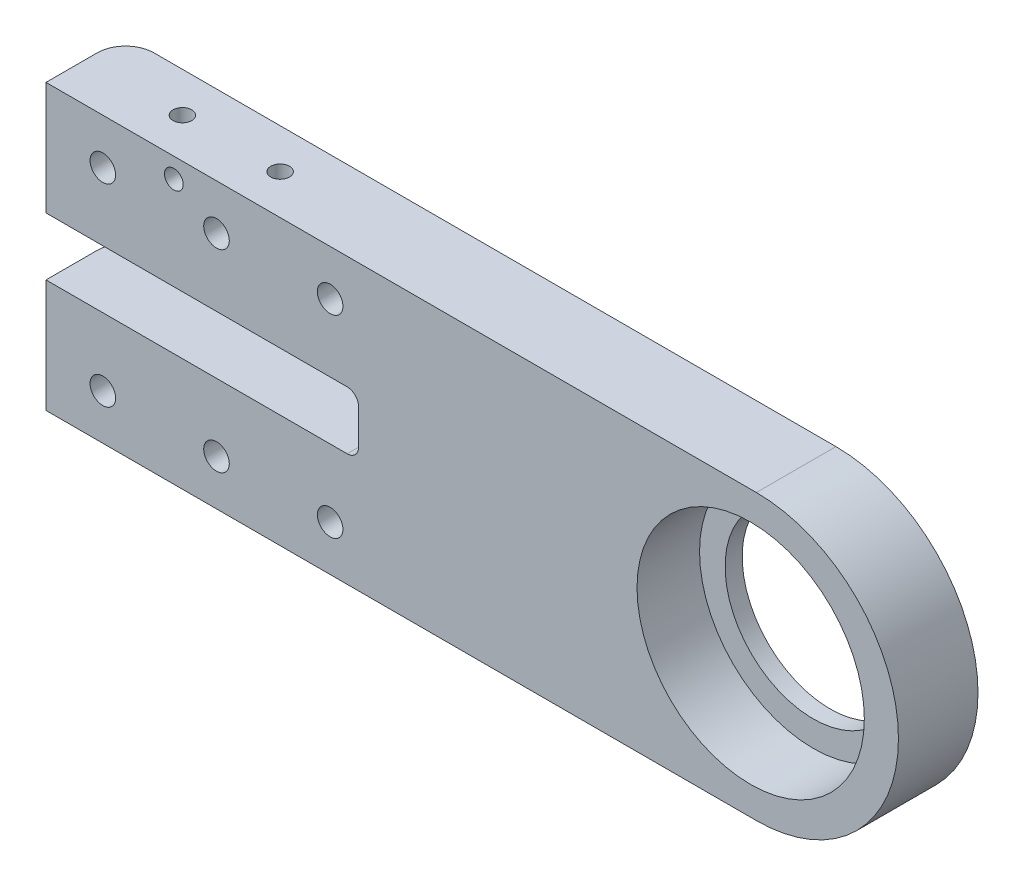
from build123d import *

# Parameters (mm, degrees)
BOSS_EXTRUDE1_DEPTH       = 14
SKETCH2_W                 = 55
SKETCH2_H                 = 10.2
CUT_EXTRUDE1_DEPTH        = 159.732479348
F_8_CLEARANCE_HOLE1_D     = 4.5
F_4_CLEARANCE_HOLE1_D     = 3.3
F_4_CLEARANCE_HOLE2_D     = 3.3
F_4_CLEARANCE_HOLE2_DEPTH = 19.899999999
HOLE1_D                   = 31.000000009
HOLE1_CBORE_D             = 40.00000001
HOLE1_CBORE_DEPTH         = 11
CHAMFER1_SIZE             = 2.45
FILLET1_R                 = 2
FILLET2_R                 = 5


with BuildPart() as part:
    # Sketch1 → Boss-Extrude1 (new body)
    with BuildSketch(Plane(origin=(0, 0, 0), x_dir=(-1, 0, 0), z_dir=(0, 0, -1))):
        with BuildLine():
            Line((-125, -50), (0, -50))
            Line((0, -50), (0, 0))
            Line((0, 0), (-125, 0))
            ThreePointArc((-125, 0), (-150, -25), (-125, -50))
        make_face()
    extrude(amount=-BOSS_EXTRUDE1_DEPTH)

    # Sketch2 → Cut-Extrude1 (cut, through all)
    with BuildSketch(Plane.XY.offset(14)):
        with Locations((27.5, -24.999999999)):
            Rectangle(SKETCH2_W, SKETCH2_H)
    extrude(amount=-CUT_EXTRUDE1_DEPTH, mode=Mode.SUBTRACT)

    # 8 Clearance Hole1 (through all)
    with Locations(Plane(origin=(0, 0, 0), x_dir=(-1, 0, 0), z_dir=(0, 0, -1))):
        with Locations((-10, -8), (-10, -42), (-30, -42), (-30, -8), (-50, -8), (-50, -42)):
            Hole(F_8_CLEARANCE_HOLE1_D / 2)

    # 4 Clearance Hole1 (through all)
    with Locations(Plane.XY.offset(14)):
        with Locations((22.5, -3.5)):
            Hole(F_4_CLEARANCE_HOLE1_D / 2)

    # 4 Clearance Hole2
    with Locations(Plane(origin=(0, 0, 0), x_dir=(1, 0, 0), z_dir=(0, 1, 0))):
        with Locations((17, -7), (34.2, -7)):
            Hole(F_4_CLEARANCE_HOLE2_D / 2, depth=F_4_CLEARANCE_HOLE2_DEPTH)

    # Hole1 (through all)
    with Locations(Plane.XY.offset(14)):
        with Locations((123.999999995, -24.999999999)):
            CounterBoreHole(HOLE1_D / 2, HOLE1_CBORE_D / 2, HOLE1_CBORE_DEPTH)

    # Chamfer1
    chamfer1_edges = [part.edges().sort_by_distance(p)[0] for p in [
        (47.75, -42, 0),
        (47.75, -8, 0),
        (27.75, -8, 0),
        (27.75, -42, 0),
        (7.75, -42, 0),
        (7.75, -8, 0),
    ]]
    chamfer(chamfer1_edges, length=CHAMFER1_SIZE)

    # Fillet1
    fillet1_edges = [part.edges().sort_by_distance(p)[0] for p in [
        (55, -19.899999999, 7),
        (55, -30.099999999, 7),
    ]]
    fillet(fillet1_edges, radius=FILLET1_R)

    # Fillet2
    fillet2_edges = [part.edges().sort_by_distance(p)[0] for p in [
        (0, -9.95, 0),
        (0, -40.05, 0),
    ]]
    fillet(fillet2_edges, radius=FILLET2_R)


solid = part.part
